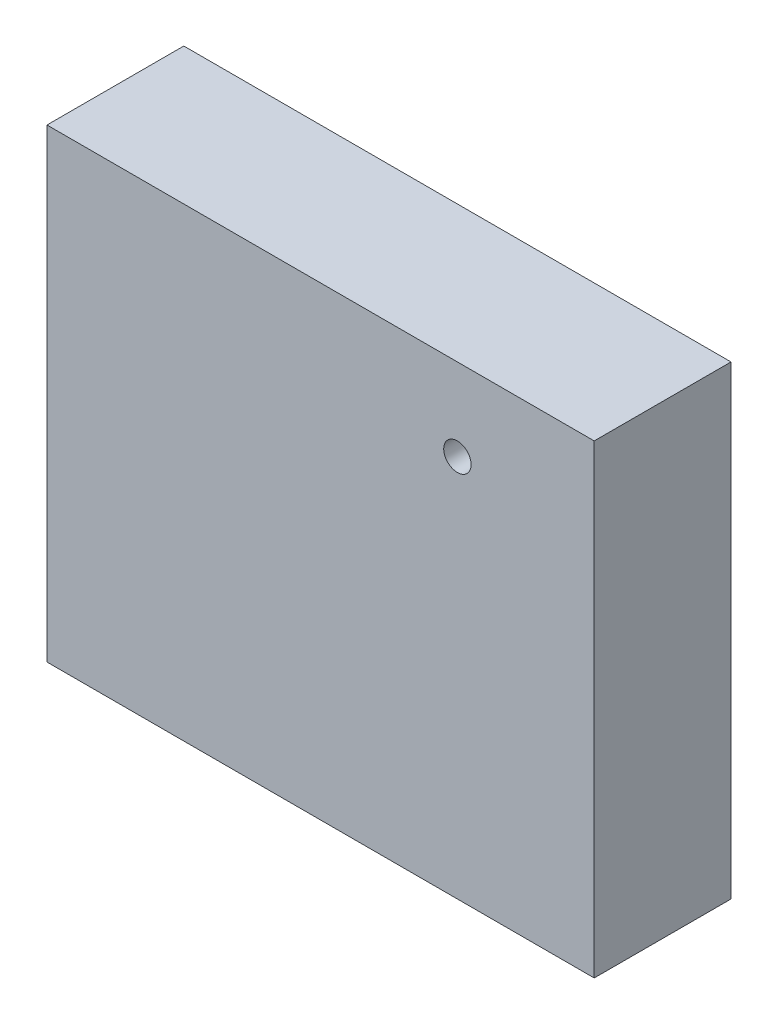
from build123d import *

# Parameters (mm, degrees)
BOSS_EXTRUDE1_DEPTH = 50
SKETCH4_R           = 5
CUT_EXTRUDE1_DEPTH  = 50
SKETCH5_W           = 200
SKETCH5_H           = 50
BOSS_EXTRUDE2_DEPTH = 10
SKETCH6_W           = 200
SKETCH6_H           = 50
BOSS_EXTRUDE3_DEPTH = 10


with BuildPart() as part:
    # Sketch1 → Boss-Extrude1 (new body)
    with BuildSketch(Plane.XY):
        Polygon((0, 0), (150, 0), (150, 150), (-50, 150), (-50, 0), align=None)
    extrude(amount=BOSS_EXTRUDE1_DEPTH)

    # Sketch4 → Cut-Extrude1 (cut)
    with BuildSketch(Plane.XY.offset(50)):
        with Locations((100, 120)):
            Circle(SKETCH4_R)
    extrude(amount=-CUT_EXTRUDE1_DEPTH, mode=Mode.SUBTRACT)

    # Sketch5 → Boss-Extrude2 (add)
    with BuildSketch(Plane.XZ):
        with Locations((50, 25)):
            Rectangle(SKETCH5_W, SKETCH5_H)
    extrude(amount=BOSS_EXTRUDE2_DEPTH)

    # Sketch6 → Boss-Extrude3 (add)
    with BuildSketch(Plane.XZ.offset(10)):
        with Locations((50, 25)):
            Rectangle(SKETCH6_W, SKETCH6_H)
    extrude(amount=BOSS_EXTRUDE3_DEPTH)


solid = part.part
